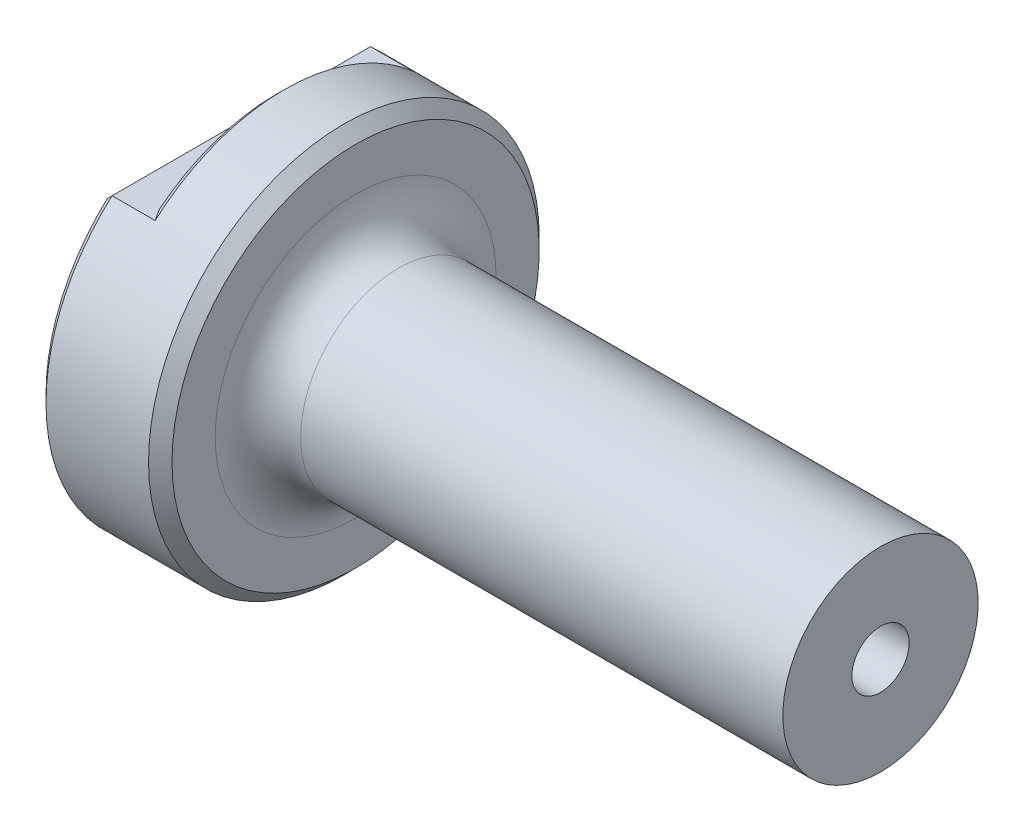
ISO-10303-21;
HEADER;
FILE_DESCRIPTION(('STEP AP214'),'2;1');
FILE_NAME('part.step','',(''),(''),'','','');
FILE_SCHEMA(('AUTOMOTIVE_DESIGN { 1 0 10303 214 1 1 1 1 }'));
ENDSEC;
DATA;
#1=APPLICATION_CONTEXT('core data for automotive mechanical design processes');
#2=APPLICATION_PROTOCOL_DEFINITION('international standard','automotive_design',2000,#1);
#3=PRODUCT_CONTEXT('',#1,'mechanical');
#4=PRODUCT('Part','Part','',(#3));
#5=PRODUCT_RELATED_PRODUCT_CATEGORY('part','',(#4));
#6=PRODUCT_DEFINITION_FORMATION('','',#4);
#7=PRODUCT_DEFINITION_CONTEXT('part definition',#1,'design');
#8=PRODUCT_DEFINITION('design','',#6,#7);
#9=PRODUCT_DEFINITION_SHAPE('','',#8);
#10=(LENGTH_UNIT() NAMED_UNIT(*) SI_UNIT(.MILLI.,.METRE.));
#11=(NAMED_UNIT(*) PLANE_ANGLE_UNIT() SI_UNIT($,.RADIAN.));
#12=(NAMED_UNIT(*) SI_UNIT($,.STERADIAN.) SOLID_ANGLE_UNIT());
#13=UNCERTAINTY_MEASURE_WITH_UNIT(LENGTH_MEASURE(1.E-05),#10,'distance_accuracy_value','');
#14=(GEOMETRIC_REPRESENTATION_CONTEXT(3) GLOBAL_UNCERTAINTY_ASSIGNED_CONTEXT((#13)) GLOBAL_UNIT_ASSIGNED_CONTEXT((#10,
#11,#12)) REPRESENTATION_CONTEXT('',''));
#15=CARTESIAN_POINT('',(0.,0.,0.));
#16=DIRECTION('',(0.,0.,1.));
#17=DIRECTION('',(1.,0.,0.));
#18=AXIS2_PLACEMENT_3D('',#15,#16,#17);
#19=CARTESIAN_POINT('',(42.06875,0.,0.));
#20=DIRECTION('',(1.,0.,0.));
#21=DIRECTION('',(0.,0.,-1.));
#22=AXIS2_PLACEMENT_3D('',#19,#20,#21);
#23=PLANE('',#22);
#24=CARTESIAN_POINT('',(42.06875,0.,0.));
#25=DIRECTION('',(1.,0.,0.));
#26=DIRECTION('',(0.,1.,0.));
#27=AXIS2_PLACEMENT_3D('',#24,#25,#26);
#28=CIRCLE('',#27,12.7);
#29=CARTESIAN_POINT('',(42.06875,12.7,0.));
#30=VERTEX_POINT('',#29);
#31=EDGE_CURVE('E102',#30,#30,#28,.T.);
#32=ORIENTED_EDGE('',*,*,#31,.T.);
#33=EDGE_LOOP('',(#32));
#34=FACE_BOUND('',#33,.T.);
#35=CARTESIAN_POINT('',(42.06875,0.,0.));
#36=DIRECTION('',(1.,0.,0.));
#37=DIRECTION('',(0.,1.,0.));
#38=AXIS2_PLACEMENT_3D('',#35,#36,#37);
#39=CIRCLE('',#38,3.72165324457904);
#40=CARTESIAN_POINT('',(42.06875,3.72165324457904,0.));
#41=VERTEX_POINT('',#40);
#42=EDGE_CURVE('E158',#41,#41,#39,.T.);
#43=ORIENTED_EDGE('',*,*,#42,.F.);
#44=EDGE_LOOP('',(#43));
#45=FACE_BOUND('',#44,.T.);
#46=ADVANCED_FACE('F33',(#34,#45),#23,.T.);
#47=CARTESIAN_POINT('',(-42.06875,0.,0.));
#48=DIRECTION('',(1.,0.,0.));
#49=DIRECTION('',(0.,0.,-1.));
#50=AXIS2_PLACEMENT_3D('',#47,#48,#49);
#51=PLANE('',#50);
#52=CARTESIAN_POINT('',(-42.06875,0.,0.));
#53=DIRECTION('',(1.,0.,0.));
#54=DIRECTION('',(0.,0.,-1.));
#55=AXIS2_PLACEMENT_3D('',#52,#53,#54);
#56=CIRCLE('',#55,24.384);
#57=CARTESIAN_POINT('',(-42.06875,18.034,-16.4120169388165));
#58=VERTEX_POINT('',#57);
#59=CARTESIAN_POINT('',(-42.06875,18.034,16.4120169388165));
#60=VERTEX_POINT('',#59);
#61=EDGE_CURVE('E53',#58,#60,#56,.F.);
#62=ORIENTED_EDGE('',*,*,#61,.T.);
#63=DIRECTION('',(0.,0.,-1.));
#64=VECTOR('',#63,1.);
#65=CARTESIAN_POINT('',(-42.06875,18.034,0.));
#66=LINE('',#65,#64);
#67=EDGE_CURVE('E127',#60,#58,#66,.T.);
#68=ORIENTED_EDGE('',*,*,#67,.T.);
#69=EDGE_LOOP('',(#62,#68));
#70=FACE_BOUND('',#69,.T.);
#71=CARTESIAN_POINT('',(-42.06875,0.,0.));
#72=DIRECTION('',(1.,0.,0.));
#73=DIRECTION('',(0.,1.,0.));
#74=AXIS2_PLACEMENT_3D('',#71,#72,#73);
#75=CIRCLE('',#74,12.4401929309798);
#76=CARTESIAN_POINT('',(-42.06875,12.4401929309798,0.));
#77=VERTEX_POINT('',#76);
#78=EDGE_CURVE('E107',#77,#77,#75,.T.);
#79=ORIENTED_EDGE('',*,*,#78,.T.);
#80=EDGE_LOOP('',(#79));
#81=FACE_BOUND('',#80,.T.);
#82=ADVANCED_FACE('F167',(#70,#81),#51,.F.);
#83=CARTESIAN_POINT('',(42.06875,0.,0.));
#84=DIRECTION('',(-1.,0.,0.));
#85=DIRECTION('',(0.,0.,1.));
#86=AXIS2_PLACEMENT_3D('',#83,#84,#85);
#87=CYLINDRICAL_SURFACE('',#86,25.4);
#88=CARTESIAN_POINT('',(-27.71775,0.,0.));
#89=DIRECTION('',(1.,0.,0.));
#90=DIRECTION('',(0.,0.,-1.));
#91=AXIS2_PLACEMENT_3D('',#88,#89,#90);
#92=CIRCLE('',#91,25.4);
#93=CARTESIAN_POINT('',(-27.71775,0.,25.4));
#94=VERTEX_POINT('',#93);
#95=EDGE_CURVE('E98',#94,#94,#92,.F.);
#96=ORIENTED_EDGE('',*,*,#95,.T.);
#97=EDGE_LOOP('',(#96));
#98=FACE_BOUND('',#97,.T.);
#99=DIRECTION('',(-1.,0.,0.));
#100=VECTOR('',#99,1.);
#101=CARTESIAN_POINT('',(42.06875,19.05,-16.8005208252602));
#102=LINE('',#101,#100);
#103=CARTESIAN_POINT('',(-41.05275,19.05,-16.8005208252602));
#104=VERTEX_POINT('',#103);
#105=CARTESIAN_POINT('',(-35.46475,19.05,-16.8005208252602));
#106=VERTEX_POINT('',#105);
#107=EDGE_CURVE('E101',#104,#106,#102,.F.);
#108=ORIENTED_EDGE('',*,*,#107,.T.);
#109=CARTESIAN_POINT('',(-35.46475,0.,0.));
#110=DIRECTION('',(-1.,0.,0.));
#111=DIRECTION('',(0.,0.,1.));
#112=AXIS2_PLACEMENT_3D('',#109,#110,#111);
#113=CIRCLE('',#112,25.4);
#114=CARTESIAN_POINT('',(-35.46475,19.05,16.8005208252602));
#115=VERTEX_POINT('',#114);
#116=EDGE_CURVE('E87',#106,#115,#113,.F.);
#117=ORIENTED_EDGE('',*,*,#116,.T.);
#118=DIRECTION('',(-1.,0.,0.));
#119=VECTOR('',#118,1.);
#120=CARTESIAN_POINT('',(42.06875,19.05,16.8005208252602));
#121=LINE('',#120,#119);
#122=CARTESIAN_POINT('',(-41.05275,19.05,16.8005208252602));
#123=VERTEX_POINT('',#122);
#124=EDGE_CURVE('E104',#115,#123,#121,.T.);
#125=ORIENTED_EDGE('',*,*,#124,.T.);
#126=CARTESIAN_POINT('',(-41.05275,0.,0.));
#127=DIRECTION('',(1.,0.,0.));
#128=DIRECTION('',(0.,0.,-1.));
#129=AXIS2_PLACEMENT_3D('',#126,#127,#128);
#130=CIRCLE('',#129,25.4);
#131=EDGE_CURVE('E97',#123,#104,#130,.T.);
#132=ORIENTED_EDGE('',*,*,#131,.T.);
#133=EDGE_LOOP('',(#108,#117,#125,#132));
#134=FACE_BOUND('',#133,.T.);
#135=ADVANCED_FACE('F189',(#98,#134),#87,.T.);
#136=CARTESIAN_POINT('',(-36.48075,0.,0.));
#137=DIRECTION('',(-1.,0.,0.));
#138=DIRECTION('',(0.,0.,1.));
#139=AXIS2_PLACEMENT_3D('',#136,#137,#138);
#140=PLANE('',#139);
#141=DIRECTION('',(0.,0.,1.));
#142=VECTOR('',#141,1.);
#143=CARTESIAN_POINT('',(-36.48075,19.05,-25.4));
#144=LINE('',#143,#142);
#145=CARTESIAN_POINT('',(-36.48075,19.05,-15.2209380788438));
#146=VERTEX_POINT('',#145);
#147=CARTESIAN_POINT('',(-36.48075,19.05,15.2209380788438));
#148=VERTEX_POINT('',#147);
#149=EDGE_CURVE('E96',#146,#148,#144,.T.);
#150=ORIENTED_EDGE('',*,*,#149,.T.);
#151=CARTESIAN_POINT('',(-36.48075,0.,0.));
#152=DIRECTION('',(-1.,0.,0.));
#153=DIRECTION('',(0.,0.,1.));
#154=AXIS2_PLACEMENT_3D('',#151,#152,#153);
#155=CIRCLE('',#154,24.384);
#156=EDGE_CURVE('E85',#148,#146,#155,.T.);
#157=ORIENTED_EDGE('',*,*,#156,.T.);
#158=EDGE_LOOP('',(#150,#157));
#159=FACE_BOUND('',#158,.T.);
#160=ADVANCED_FACE('F95',(#159),#140,.T.);
#161=CARTESIAN_POINT('',(-36.48075,19.05,-25.4));
#162=DIRECTION('',(0.,-1.,0.));
#163=DIRECTION('',(0.,0.,-1.));
#164=AXIS2_PLACEMENT_3D('',#161,#162,#163);
#165=PLANE('',#164);
#166=ORIENTED_EDGE('',*,*,#107,.F.);
#167=DIRECTION('',(0.,0.,1.));
#168=VECTOR('',#167,1.);
#169=CARTESIAN_POINT('',(-41.05275,19.05,-25.4));
#170=LINE('',#169,#168);
#171=EDGE_CURVE('E91',#104,#123,#170,.T.);
#172=ORIENTED_EDGE('',*,*,#171,.T.);
#173=ORIENTED_EDGE('',*,*,#124,.F.);
#174=CARTESIAN_POINT('',(-35.46475,19.05,16.8005208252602));
#175=CARTESIAN_POINT('',(-35.5510969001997,19.05,16.6699759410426));
#176=CARTESIAN_POINT('',(-35.637050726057,19.05,16.5391707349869));
#177=CARTESIAN_POINT('',(-35.8081291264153,19.05,16.2770272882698));
#178=CARTESIAN_POINT('',(-35.8932537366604,19.05,16.1456890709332));
#179=CARTESIAN_POINT('',(-36.0626383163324,19.05,15.8824555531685));
#180=CARTESIAN_POINT('',(-36.1468982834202,19.05,15.7505602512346));
#181=CARTESIAN_POINT('',(-36.3145140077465,19.05,15.486188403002));
#182=CARTESIAN_POINT('',(-36.3978697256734,19.05,15.3537118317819));
#183=CARTESIAN_POINT('',(-36.48075,19.05,15.2209380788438));
#184=B_SPLINE_CURVE_WITH_KNOTS('',3,(#174,#175,#176,#177,#178,#179,#180,#181,#182,#183),
.UNSPECIFIED.,.F.,.F.,(4,2,2,2,4),(0.,0.469552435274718,0.939084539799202,1.40861791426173,
1.87817162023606),.UNSPECIFIED.);
#185=EDGE_CURVE('E11',#115,#148,#184,.T.);
#186=ORIENTED_EDGE('',*,*,#185,.T.);
#187=ORIENTED_EDGE('',*,*,#149,.F.);
#188=CARTESIAN_POINT('',(-36.48075,19.05,-15.2209380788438));
#189=CARTESIAN_POINT('',(-36.3978697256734,19.05,-15.3537118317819));
#190=CARTESIAN_POINT('',(-36.3145140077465,19.05,-15.486188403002));
#191=CARTESIAN_POINT('',(-36.1468982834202,19.05,-15.7505602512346));
#192=CARTESIAN_POINT('',(-36.0626383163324,19.05,-15.8824555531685));
#193=CARTESIAN_POINT('',(-35.8932537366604,19.05,-16.1456890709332));
#194=CARTESIAN_POINT('',(-35.8081291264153,19.05,-16.2770272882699));
#195=CARTESIAN_POINT('',(-35.637050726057,19.05,-16.5391707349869));
#196=CARTESIAN_POINT('',(-35.5510969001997,19.05,-16.6699759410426));
#197=CARTESIAN_POINT('',(-35.46475,19.05,-16.8005208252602));
#198=B_SPLINE_CURVE_WITH_KNOTS('',3,(#188,#189,#190,#191,#192,#193,#194,#195,#196,#197),
.UNSPECIFIED.,.F.,.F.,(4,2,2,2,4),(0.,0.469553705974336,0.939087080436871,1.40861918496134,
1.87817162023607),.UNSPECIFIED.);
#199=EDGE_CURVE('E46',#146,#106,#198,.T.);
#200=ORIENTED_EDGE('',*,*,#199,.T.);
#201=EDGE_LOOP('',(#166,#172,#173,#186,#187,#200));
#202=FACE_BOUND('',#201,.T.);
#203=ADVANCED_FACE('F100',(#202),#165,.F.);
#204=CARTESIAN_POINT('',(-26.19375,-25.4,0.));
#205=DIRECTION('',(1.,0.,0.));
#206=DIRECTION('',(0.,1.,0.));
#207=AXIS2_PLACEMENT_3D('',#204,#205,#206);
#208=PLANE('',#207);
#209=CARTESIAN_POINT('',(-26.19375,0.,0.));
#210=DIRECTION('',(1.,0.,0.));
#211=DIRECTION('',(0.,1.,0.));
#212=AXIS2_PLACEMENT_3D('',#209,#210,#211);
#213=CIRCLE('',#212,23.876);
#214=CARTESIAN_POINT('',(-26.19375,0.,23.876));
#215=VERTEX_POINT('',#214);
#216=EDGE_CURVE('E119',#215,#215,#213,.T.);
#217=ORIENTED_EDGE('',*,*,#216,.T.);
#218=EDGE_LOOP('',(#217));
#219=FACE_BOUND('',#218,.T.);
#220=CARTESIAN_POINT('',(-26.19375,0.,0.));
#221=DIRECTION('',(1.,0.,0.));
#222=DIRECTION('',(0.,1.,0.));
#223=AXIS2_PLACEMENT_3D('',#220,#221,#222);
#224=CIRCLE('',#223,18.25625);
#225=CARTESIAN_POINT('',(-26.19375,18.25625,0.));
#226=VERTEX_POINT('',#225);
#227=EDGE_CURVE('E116',#226,#226,#224,.F.);
#228=ORIENTED_EDGE('',*,*,#227,.T.);
#229=EDGE_LOOP('',(#228));
#230=FACE_BOUND('',#229,.T.);
#231=ADVANCED_FACE('F181',(#219,#230),#208,.T.);
#232=CARTESIAN_POINT('',(42.06875,0.,0.));
#233=DIRECTION('',(1.,0.,0.));
#234=DIRECTION('',(0.,1.,0.));
#235=AXIS2_PLACEMENT_3D('',#232,#233,#234);
#236=CYLINDRICAL_SURFACE('',#235,12.7);
#237=CARTESIAN_POINT('',(-20.6375,0.,0.));
#238=DIRECTION('',(1.,0.,0.));
#239=DIRECTION('',(0.,1.,0.));
#240=AXIS2_PLACEMENT_3D('',#237,#238,#239);
#241=CIRCLE('',#240,12.7);
#242=CARTESIAN_POINT('',(-20.6375,12.7,0.));
#243=VERTEX_POINT('',#242);
#244=EDGE_CURVE('E113',#243,#243,#241,.T.);
#245=ORIENTED_EDGE('',*,*,#244,.T.);
#246=EDGE_LOOP('',(#245));
#247=FACE_BOUND('',#246,.T.);
#248=ORIENTED_EDGE('',*,*,#31,.F.);
#249=EDGE_LOOP('',(#248));
#250=FACE_BOUND('',#249,.T.);
#251=ADVANCED_FACE('F172',(#247,#250),#236,.T.);
#252=CARTESIAN_POINT('',(-56.49595,0.,0.));
#253=DIRECTION('',(1.,0.,0.));
#254=DIRECTION('',(0.,1.,0.));
#255=AXIS2_PLACEMENT_3D('',#252,#253,#254);
#256=SPHERICAL_SURFACE('',#255,19.05);
#257=CARTESIAN_POINT('',(-37.5495847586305,0.,0.));
#258=DIRECTION('',(1.,0.,0.));
#259=DIRECTION('',(0.,1.,0.));
#260=AXIS2_PLACEMENT_3D('',#257,#258,#259);
#261=CIRCLE('',#260,1.984375);
#262=CARTESIAN_POINT('',(-37.5495847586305,1.98437500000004,0.));
#263=VERTEX_POINT('',#262);
#264=EDGE_CURVE('E155',#263,#263,#261,.T.);
#265=CARTESIAN_POINT('',(-37.5495847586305,1.98437500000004,0.));
#266=CARTESIAN_POINT('',(-37.5621362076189,2.1042148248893,0.));
#267=CARTESIAN_POINT('',(-37.5758249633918,2.22393552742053,0.));
#268=CARTESIAN_POINT('',(-37.605471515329,2.46309566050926,0.));
#269=CARTESIAN_POINT('',(-37.6214293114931,2.58253509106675,0.));
#270=CARTESIAN_POINT('',(-37.6556083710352,2.82108965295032,0.));
#271=CARTESIAN_POINT('',(-37.673829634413,2.94020478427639,0.));
#272=CARTESIAN_POINT('',(-37.7125290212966,3.17806786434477,0.));
#273=CARTESIAN_POINT('',(-37.7330071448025,3.29681581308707,0.));
#274=CARTESIAN_POINT('',(-37.7762128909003,3.53390176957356,0.));
#275=CARTESIAN_POINT('',(-37.7989405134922,3.65223977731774,0.));
#276=CARTESIAN_POINT('',(-37.8466370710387,3.88846324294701,0.));
#277=CARTESIAN_POINT('',(-37.8716060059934,4.0063487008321,0.));
#278=CARTESIAN_POINT('',(-37.9237761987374,4.24162462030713,0.));
#279=CARTESIAN_POINT('',(-37.9509774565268,4.35901508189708,0.));
#280=CARTESIAN_POINT('',(-38.0076025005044,4.59325874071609,0.));
#281=CARTESIAN_POINT('',(-38.0370262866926,4.71011193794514,0.));
#282=CARTESIAN_POINT('',(-38.0980857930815,4.94323899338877,0.));
#283=CARTESIAN_POINT('',(-38.1297215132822,5.05951285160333,0.));
#284=CARTESIAN_POINT('',(-38.1951934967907,5.29143936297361,0.));
#285=CARTESIAN_POINT('',(-38.2290297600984,5.40709201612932,0.));
#286=CARTESIAN_POINT('',(-38.2988906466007,5.63773447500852,0.));
#287=CARTESIAN_POINT('',(-38.3349152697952,5.75272428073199,0.));
#288=CARTESIAN_POINT('',(-38.4091399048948,5.98199964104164,0.));
#289=CARTESIAN_POINT('',(-38.4473399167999,6.09628519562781,0.));
#290=CARTESIAN_POINT('',(-38.5259015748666,6.32411090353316,0.));
#291=CARTESIAN_POINT('',(-38.5662632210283,6.43765105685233,0.));
#292=CARTESIAN_POINT('',(-38.6491336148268,6.6639450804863,0.));
#293=CARTESIAN_POINT('',(-38.6916423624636,6.7766989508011,0.));
#294=CARTESIAN_POINT('',(-38.7787916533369,7.00137980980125,0.));
#295=CARTESIAN_POINT('',(-38.8234321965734,7.11330679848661,0.));
#296=CARTESIAN_POINT('',(-38.9148290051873,7.33629359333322,0.));
#297=CARTESIAN_POINT('',(-38.9615852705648,7.44735339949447,0.));
#298=CARTESIAN_POINT('',(-39.0571966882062,7.66856584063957,0.));
#299=CARTESIAN_POINT('',(-39.1060518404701,7.7787184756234,0.));
#300=CARTESIAN_POINT('',(-39.2058434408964,7.99807691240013,0.));
#301=CARTESIAN_POINT('',(-39.2567798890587,8.10728271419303,0.));
#302=CARTESIAN_POINT('',(-39.3607157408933,8.32470816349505,0.));
#303=CARTESIAN_POINT('',(-39.4137151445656,8.43292781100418,0.));
#304=CARTESIAN_POINT('',(-39.5217578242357,8.6483419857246,0.));
#305=CARTESIAN_POINT('',(-39.5768011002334,8.75553651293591,0.));
#306=CARTESIAN_POINT('',(-39.6889117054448,8.96886185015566,0.));
#307=CARTESIAN_POINT('',(-39.7459790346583,9.0749926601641,0.));
#308=CARTESIAN_POINT('',(-39.8621171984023,9.28615234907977,0.));
#309=CARTESIAN_POINT('',(-39.9211880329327,9.39118122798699,0.));
#310=CARTESIAN_POINT('',(-40.0413119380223,9.60009923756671,0.));
#311=CARTESIAN_POINT('',(-40.1023650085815,9.70398836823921,0.));
#312=CARTESIAN_POINT('',(-40.2264314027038,9.91058947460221,0.));
#313=CARTESIAN_POINT('',(-40.2894447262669,10.0133014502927,0.));
#314=CARTESIAN_POINT('',(-40.4174089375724,10.2175112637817,0.));
#315=CARTESIAN_POINT('',(-40.4823598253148,10.3190091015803,0.));
#316=CARTESIAN_POINT('',(-40.6141757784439,10.520754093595,0.));
#317=CARTESIAN_POINT('',(-40.6810408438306,10.6210012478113,0.));
#318=CARTESIAN_POINT('',(-40.8166610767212,10.8202087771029,0.));
#319=CARTESIAN_POINT('',(-40.8854162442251,10.9191691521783,0.));
#320=CARTESIAN_POINT('',(-41.0247919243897,11.1157674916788,0.));
#321=CARTESIAN_POINT('',(-41.0954124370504,11.2134054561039,0.));
#322=CARTESIAN_POINT('',(-41.2384933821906,11.4073238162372,0.));
#323=CARTESIAN_POINT('',(-41.31095381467,11.5036042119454,0.));
#324=CARTESIAN_POINT('',(-41.4576884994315,11.6947727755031,0.));
#325=CARTESIAN_POINT('',(-41.5319627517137,11.7896609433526,0.));
#326=CARTESIAN_POINT('',(-41.6822983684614,11.9780108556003,0.));
#327=CARTESIAN_POINT('',(-41.758359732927,12.0714725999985,0.));
#328=CARTESIAN_POINT('',(-41.9122420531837,12.2569361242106,0.));
#329=CARTESIAN_POINT('',(-41.9900630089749,12.3489379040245,0.));
#330=CARTESIAN_POINT('',(-42.06875,12.4401929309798,0.));
#331=B_SPLINE_CURVE_WITH_KNOTS('',3,(#265,#266,#267,#268,#269,#270,#271,#272,#273,#274,#275,
#276,#277,#278,#279,#280,#281,#282,#283,#284,#285,#286,#287,#288,#289,#290,#291,#292,#293,#294,
#295,#296,#297,#298,#299,#300,#301,#302,#303,#304,#305,#306,#307,#308,#309,#310,#311,#312,#313,
#314,#315,#316,#317,#318,#319,#320,#321,#322,#323,#324,#325,#326,#327,#328,#329,#330),
.UNSPECIFIED.,.F.,.F.,(4,2,2,2,2,2,2,2,2,2,2,2,2,2,2,2,2,2,2,2,2,2,2,2,2,2,2,2,2,2,2,2,4),(0.,
0.361480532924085,0.722961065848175,1.08444159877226,1.44592213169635,1.80740266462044,
2.16888319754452,2.53036373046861,2.8918442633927,3.25332479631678,3.61480532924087,
3.97628586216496,4.33776639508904,4.69924692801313,5.06072746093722,5.4222079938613,
5.7836885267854,6.14516905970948,6.50664959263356,6.86813012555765,7.22961065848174,
7.59109119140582,7.95257172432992,8.314052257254,8.67553279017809,9.03701332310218,
9.39849385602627,9.75997438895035,10.1214549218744,10.4829354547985,10.8444159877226,
11.2058965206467,11.5673770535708),.UNSPECIFIED.);
#332=EDGE_CURVE('BSEAM169',#263,#77,#331,.T.);
#333=ORIENTED_EDGE('',*,*,#264,.T.);
#334=ORIENTED_EDGE('',*,*,#78,.F.);
#335=ORIENTED_EDGE('',*,*,#332,.T.);
#336=ORIENTED_EDGE('',*,*,#332,.F.);
#337=EDGE_LOOP('',(#333,#335,#334,#336));
#338=FACE_BOUND('',#337,.T.);
#339=ADVANCED_FACE('F169',(#338),#256,.F.);
#340=CARTESIAN_POINT('',(-37.5495847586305,0.,0.));
#341=DIRECTION('',(1.,0.,0.));
#342=DIRECTION('',(0.,1.,0.));
#343=AXIS2_PLACEMENT_3D('',#340,#341,#342);
#344=CONICAL_SURFACE('',#343,1.984375,0.0218166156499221);
#345=ORIENTED_EDGE('',*,*,#42,.T.);
#346=EDGE_LOOP('',(#345));
#347=FACE_BOUND('',#346,.T.);
#348=ORIENTED_EDGE('',*,*,#264,.F.);
#349=EDGE_LOOP('',(#348));
#350=FACE_BOUND('',#349,.T.);
#351=ADVANCED_FACE('F171',(#347,#350),#344,.F.);
#352=CARTESIAN_POINT('',(-20.6375,0.,0.));
#353=DIRECTION('',(1.,0.,0.));
#354=DIRECTION('',(0.,1.,0.));
#355=AXIS2_PLACEMENT_3D('',#352,#353,#354);
#356=TOROIDAL_SURFACE('',#355,18.25625,5.55625);
#357=ORIENTED_EDGE('',*,*,#227,.F.);
#358=EDGE_LOOP('',(#357));
#359=FACE_BOUND('',#358,.T.);
#360=ORIENTED_EDGE('',*,*,#244,.F.);
#361=EDGE_LOOP('',(#360));
#362=FACE_BOUND('',#361,.T.);
#363=ADVANCED_FACE('F178',(#359,#362),#356,.F.);
#364=CARTESIAN_POINT('',(-26.19375,0.,0.));
#365=DIRECTION('',(-1.,0.,0.));
#366=DIRECTION('',(0.,0.,1.));
#367=AXIS2_PLACEMENT_3D('',#364,#365,#366);
#368=CONICAL_SURFACE('',#367,23.876,0.785398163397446);
#369=CARTESIAN_POINT('',(-27.71775,0.,25.4));
#370=CARTESIAN_POINT('',(-27.701875,0.,25.384125));
#371=CARTESIAN_POINT('',(-27.686,0.,25.36825));
#372=CARTESIAN_POINT('',(-27.65425,0.,25.3365));
#373=CARTESIAN_POINT('',(-27.638375,0.,25.320625));
#374=CARTESIAN_POINT('',(-27.606625,0.,25.288875));
#375=CARTESIAN_POINT('',(-27.59075,0.,25.273));
#376=CARTESIAN_POINT('',(-27.559,0.,25.24125));
#377=CARTESIAN_POINT('',(-27.543125,0.,25.225375));
#378=CARTESIAN_POINT('',(-27.511375,0.,25.193625));
#379=CARTESIAN_POINT('',(-27.4955,0.,25.17775));
#380=CARTESIAN_POINT('',(-27.46375,0.,25.146));
#381=CARTESIAN_POINT('',(-27.447875,0.,25.130125));
#382=CARTESIAN_POINT('',(-27.416125,0.,25.098375));
#383=CARTESIAN_POINT('',(-27.40025,0.,25.0825));
#384=CARTESIAN_POINT('',(-27.3685,0.,25.05075));
#385=CARTESIAN_POINT('',(-27.352625,0.,25.034875));
#386=CARTESIAN_POINT('',(-27.320875,0.,25.003125));
#387=CARTESIAN_POINT('',(-27.305,0.,24.98725));
#388=CARTESIAN_POINT('',(-27.27325,0.,24.9555));
#389=CARTESIAN_POINT('',(-27.257375,0.,24.939625));
#390=CARTESIAN_POINT('',(-27.225625,0.,24.907875));
#391=CARTESIAN_POINT('',(-27.20975,0.,24.892));
#392=CARTESIAN_POINT('',(-27.178,0.,24.86025));
#393=CARTESIAN_POINT('',(-27.162125,0.,24.844375));
#394=CARTESIAN_POINT('',(-27.130375,0.,24.812625));
#395=CARTESIAN_POINT('',(-27.1145,0.,24.79675));
#396=CARTESIAN_POINT('',(-27.08275,0.,24.765));
#397=CARTESIAN_POINT('',(-27.066875,0.,24.749125));
#398=CARTESIAN_POINT('',(-27.035125,0.,24.717375));
#399=CARTESIAN_POINT('',(-27.01925,0.,24.7015));
#400=CARTESIAN_POINT('',(-26.9875,0.,24.66975));
#401=CARTESIAN_POINT('',(-26.971625,0.,24.653875));
#402=CARTESIAN_POINT('',(-26.939875,0.,24.622125));
#403=CARTESIAN_POINT('',(-26.924,0.,24.60625));
#404=CARTESIAN_POINT('',(-26.89225,0.,24.5745));
#405=CARTESIAN_POINT('',(-26.876375,0.,24.558625));
#406=CARTESIAN_POINT('',(-26.844625,0.,24.526875));
#407=CARTESIAN_POINT('',(-26.82875,0.,24.511));
#408=CARTESIAN_POINT('',(-26.797,0.,24.47925));
#409=CARTESIAN_POINT('',(-26.781125,0.,24.463375));
#410=CARTESIAN_POINT('',(-26.749375,0.,24.431625));
#411=CARTESIAN_POINT('',(-26.7335,0.,24.41575));
#412=CARTESIAN_POINT('',(-26.70175,0.,24.384));
#413=CARTESIAN_POINT('',(-26.685875,0.,24.368125));
#414=CARTESIAN_POINT('',(-26.654125,0.,24.336375));
#415=CARTESIAN_POINT('',(-26.63825,0.,24.3205));
#416=CARTESIAN_POINT('',(-26.6065,0.,24.28875));
#417=CARTESIAN_POINT('',(-26.590625,0.,24.272875));
#418=CARTESIAN_POINT('',(-26.558875,0.,24.241125));
#419=CARTESIAN_POINT('',(-26.543,0.,24.22525));
#420=CARTESIAN_POINT('',(-26.51125,0.,24.1935));
#421=CARTESIAN_POINT('',(-26.495375,0.,24.177625));
#422=CARTESIAN_POINT('',(-26.463625,0.,24.145875));
#423=CARTESIAN_POINT('',(-26.44775,0.,24.13));
#424=CARTESIAN_POINT('',(-26.416,0.,24.09825));
#425=CARTESIAN_POINT('',(-26.400125,0.,24.082375));
#426=CARTESIAN_POINT('',(-26.368375,0.,24.050625));
#427=CARTESIAN_POINT('',(-26.3525,0.,24.03475));
#428=CARTESIAN_POINT('',(-26.32075,0.,24.003));
#429=CARTESIAN_POINT('',(-26.304875,0.,23.987125));
#430=CARTESIAN_POINT('',(-26.273125,0.,23.955375));
#431=CARTESIAN_POINT('',(-26.25725,0.,23.9395));
#432=CARTESIAN_POINT('',(-26.2255,0.,23.90775));
#433=CARTESIAN_POINT('',(-26.209625,0.,23.891875));
#434=CARTESIAN_POINT('',(-26.19375,0.,23.876));
#435=B_SPLINE_CURVE_WITH_KNOTS('',3,(#369,#370,#371,#372,#373,#374,#375,#376,#377,#378,#379,
#380,#381,#382,#383,#384,#385,#386,#387,#388,#389,#390,#391,#392,#393,#394,#395,#396,#397,#398,
#399,#400,#401,#402,#403,#404,#405,#406,#407,#408,#409,#410,#411,#412,#413,#414,#415,#416,#417,
#418,#419,#420,#421,#422,#423,#424,#425,#426,#427,#428,#429,#430,#431,#432,#433,#434),
.UNSPECIFIED.,.F.,.F.,(4,2,2,2,2,2,2,2,2,2,2,2,2,2,2,2,2,2,2,2,2,2,2,2,2,2,2,2,2,2,2,2,4),(0.,
0.0673519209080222,0.13470384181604,0.202055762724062,0.269407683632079,0.336759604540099,
0.404111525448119,0.471463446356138,0.538815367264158,0.606167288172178,0.673519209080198,
0.740871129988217,0.808223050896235,0.875574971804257,0.942926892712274,1.0102788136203,
1.07763073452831,1.14498265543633,1.21233457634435,1.27968649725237,1.34703841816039,
1.41439033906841,1.48174225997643,1.54909418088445,1.61644610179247,1.68379802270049,
1.75114994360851,1.81850186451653,1.88585378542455,1.95320570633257,2.02055762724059,
2.08790954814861,2.15526146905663),.UNSPECIFIED.);
#436=EDGE_CURVE('BSEAM145',#94,#215,#435,.T.);
#437=ORIENTED_EDGE('',*,*,#95,.F.);
#438=ORIENTED_EDGE('',*,*,#216,.F.);
#439=ORIENTED_EDGE('',*,*,#436,.T.);
#440=ORIENTED_EDGE('',*,*,#436,.F.);
#441=EDGE_LOOP('',(#437,#439,#438,#440));
#442=FACE_BOUND('',#441,.T.);
#443=ADVANCED_FACE('F145',(#442),#368,.T.);
#444=CARTESIAN_POINT('',(-36.48075,0.,0.));
#445=DIRECTION('',(1.,0.,0.));
#446=DIRECTION('',(0.,0.,-1.));
#447=AXIS2_PLACEMENT_3D('',#444,#445,#446);
#448=CONICAL_SURFACE('',#447,24.384,0.785398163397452);
#449=ORIENTED_EDGE('',*,*,#185,.F.);
#450=ORIENTED_EDGE('',*,*,#116,.F.);
#451=ORIENTED_EDGE('',*,*,#199,.F.);
#452=ORIENTED_EDGE('',*,*,#156,.F.);
#453=EDGE_LOOP('',(#449,#450,#451,#452));
#454=FACE_BOUND('',#453,.T.);
#455=ADVANCED_FACE('F84',(#454),#448,.T.);
#456=CARTESIAN_POINT('',(-41.05275,0.,0.));
#457=DIRECTION('',(1.,0.,0.));
#458=DIRECTION('',(0.,0.,-1.));
#459=AXIS2_PLACEMENT_3D('',#456,#457,#458);
#460=CONICAL_SURFACE('',#459,25.4,0.78539816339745);
#461=CARTESIAN_POINT('',(-42.06875,18.034,-16.4120169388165));
#462=CARTESIAN_POINT('',(-41.899551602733,18.203198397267,-16.4774733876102));
#463=CARTESIAN_POINT('',(-41.7302857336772,18.3724642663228,-16.5425769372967));
#464=CARTESIAN_POINT('',(-41.3916190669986,18.7111309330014,-16.6720782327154));
#465=CARTESIAN_POINT('',(-41.2222182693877,18.8805317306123,-16.7364759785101));
#466=CARTESIAN_POINT('',(-41.05275,19.05,-16.8005208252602));
#467=B_SPLINE_CURVE_WITH_KNOTS('',3,(#461,#462,#463,#464,#465,#466),.UNSPECIFIED.,.F.,.F.,(4,2,
4),(0.,0.744219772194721,1.48843947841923),.UNSPECIFIED.);
#468=EDGE_CURVE('E61',#104,#58,#467,.F.);
#469=ORIENTED_EDGE('',*,*,#468,.F.);
#470=ORIENTED_EDGE('',*,*,#131,.F.);
#471=CARTESIAN_POINT('',(-41.05275,19.05,16.8005208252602));
#472=CARTESIAN_POINT('',(-41.2222182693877,18.8805317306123,16.7364759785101));
#473=CARTESIAN_POINT('',(-41.3916190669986,18.7111309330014,16.6720782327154));
#474=CARTESIAN_POINT('',(-41.7302857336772,18.3724642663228,16.5425769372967));
#475=CARTESIAN_POINT('',(-41.899551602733,18.203198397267,16.4774733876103));
#476=CARTESIAN_POINT('',(-42.06875,18.034,16.4120169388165));
#477=B_SPLINE_CURVE_WITH_KNOTS('',3,(#471,#472,#473,#474,#475,#476),.UNSPECIFIED.,.F.,.F.,(4,2,
4),(0.,0.744219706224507,1.48843947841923),.UNSPECIFIED.);
#478=EDGE_CURVE('E38',#60,#123,#477,.F.);
#479=ORIENTED_EDGE('',*,*,#478,.F.);
#480=ORIENTED_EDGE('',*,*,#61,.F.);
#481=EDGE_LOOP('',(#469,#470,#479,#480));
#482=FACE_BOUND('',#481,.T.);
#483=ADVANCED_FACE('F144',(#482),#460,.T.);
#484=CARTESIAN_POINT('',(-42.06875,18.034,0.));
#485=DIRECTION('',(0.707106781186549,-0.707106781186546,0.));
#486=DIRECTION('',(0.,0.,-1.));
#487=AXIS2_PLACEMENT_3D('',#484,#485,#486);
#488=PLANE('',#487);
#489=ORIENTED_EDGE('',*,*,#478,.T.);
#490=ORIENTED_EDGE('',*,*,#171,.F.);
#491=ORIENTED_EDGE('',*,*,#468,.T.);
#492=ORIENTED_EDGE('',*,*,#67,.F.);
#493=EDGE_LOOP('',(#489,#490,#491,#492));
#494=FACE_BOUND('',#493,.T.);
#495=ADVANCED_FACE('F35',(#494),#488,.F.);
#496=CLOSED_SHELL('',(#46,#82,#135,#160,#203,#231,#251,#339,#351,#363,#443,#455,#483,#495));
#497=MANIFOLD_SOLID_BREP('B2',#496);
#498=ADVANCED_BREP_SHAPE_REPRESENTATION('',(#18,#497),#14);
#499=SHAPE_DEFINITION_REPRESENTATION(#9,#498);
ENDSEC;
END-ISO-10303-21;
